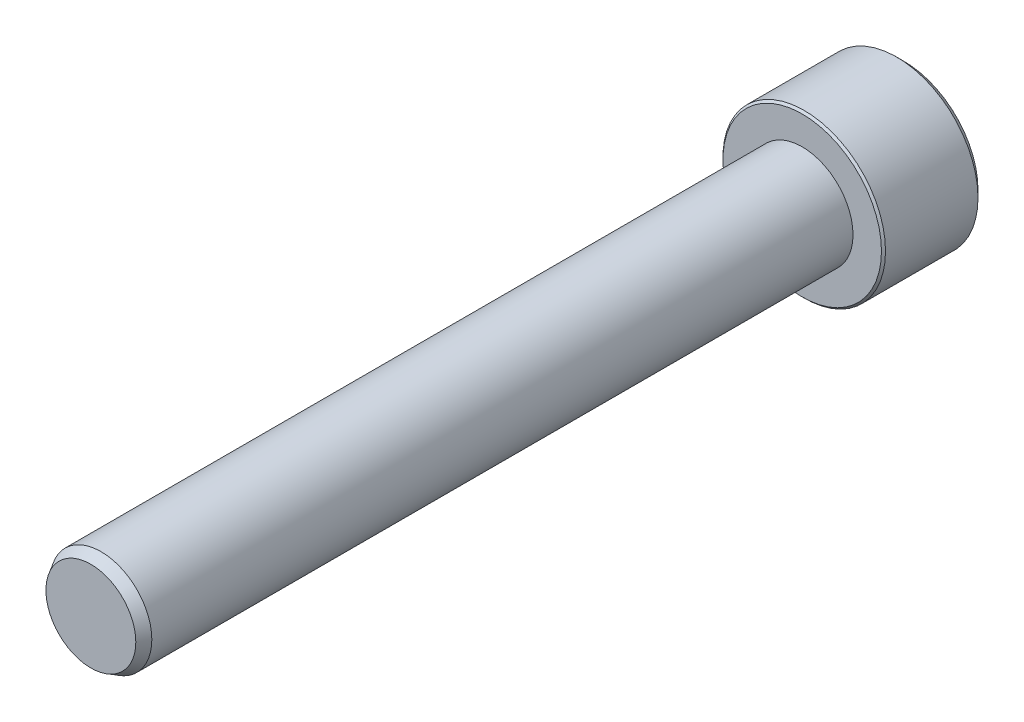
ISO-10303-21;
HEADER;
FILE_DESCRIPTION(('STEP AP214'),'2;1');
FILE_NAME('part.step','',(''),(''),'','','');
FILE_SCHEMA(('AUTOMOTIVE_DESIGN { 1 0 10303 214 1 1 1 1 }'));
ENDSEC;
DATA;
#1=APPLICATION_CONTEXT('core data for automotive mechanical design processes');
#2=APPLICATION_PROTOCOL_DEFINITION('international standard','automotive_design',2000,#1);
#3=PRODUCT_CONTEXT('',#1,'mechanical');
#4=PRODUCT('Part','Part','',(#3));
#5=PRODUCT_RELATED_PRODUCT_CATEGORY('part','',(#4));
#6=PRODUCT_DEFINITION_FORMATION('','',#4);
#7=PRODUCT_DEFINITION_CONTEXT('part definition',#1,'design');
#8=PRODUCT_DEFINITION('design','',#6,#7);
#9=PRODUCT_DEFINITION_SHAPE('','',#8);
#10=(LENGTH_UNIT() NAMED_UNIT(*) SI_UNIT(.MILLI.,.METRE.));
#11=(NAMED_UNIT(*) PLANE_ANGLE_UNIT() SI_UNIT($,.RADIAN.));
#12=(NAMED_UNIT(*) SI_UNIT($,.STERADIAN.) SOLID_ANGLE_UNIT());
#13=UNCERTAINTY_MEASURE_WITH_UNIT(LENGTH_MEASURE(1.E-05),#10,'distance_accuracy_value','');
#14=(GEOMETRIC_REPRESENTATION_CONTEXT(3) GLOBAL_UNCERTAINTY_ASSIGNED_CONTEXT((#13)) GLOBAL_UNIT_ASSIGNED_CONTEXT((#10,
#11,#12)) REPRESENTATION_CONTEXT('',''));
#15=CARTESIAN_POINT('',(0.,0.,0.));
#16=DIRECTION('',(0.,0.,1.));
#17=DIRECTION('',(1.,0.,0.));
#18=AXIS2_PLACEMENT_3D('',#15,#16,#17);
#19=CARTESIAN_POINT('',(0.,0.,-10.));
#20=DIRECTION('',(0.,0.,1.));
#21=DIRECTION('',(1.,0.,0.));
#22=AXIS2_PLACEMENT_3D('',#19,#20,#21);
#23=PLANE('',#22);
#24=CARTESIAN_POINT('',(0.,0.,-10.));
#25=DIRECTION('',(0.,0.,1.));
#26=DIRECTION('',(1.,0.,0.));
#27=AXIS2_PLACEMENT_3D('',#24,#25,#26);
#28=CIRCLE('',#27,7.3);
#29=CARTESIAN_POINT('',(7.3,0.,-10.));
#30=VERTEX_POINT('',#29);
#31=EDGE_CURVE('E140',#30,#30,#28,.F.);
#32=ORIENTED_EDGE('',*,*,#31,.T.);
#33=EDGE_LOOP('',(#32));
#34=FACE_BOUND('',#33,.T.);
#35=DIRECTION('',(-0.5,-0.866025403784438,0.));
#36=VECTOR('',#35,1.);
#37=CARTESIAN_POINT('',(-2.3094010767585,4.,-10.));
#38=LINE('',#37,#36);
#39=CARTESIAN_POINT('',(-2.3094010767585,4.,-10.));
#40=VERTEX_POINT('',#39);
#41=CARTESIAN_POINT('',(-4.61880215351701,0.,-10.));
#42=VERTEX_POINT('',#41);
#43=EDGE_CURVE('E47',#40,#42,#38,.T.);
#44=ORIENTED_EDGE('',*,*,#43,.T.);
#45=DIRECTION('',(0.5,-0.866025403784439,0.));
#46=VECTOR('',#45,1.);
#47=CARTESIAN_POINT('',(-4.61880215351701,0.,-10.));
#48=LINE('',#47,#46);
#49=CARTESIAN_POINT('',(-2.3094010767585,-4.,-10.));
#50=VERTEX_POINT('',#49);
#51=EDGE_CURVE('E87',#42,#50,#48,.T.);
#52=ORIENTED_EDGE('',*,*,#51,.T.);
#53=DIRECTION('',(1.,0.,0.));
#54=VECTOR('',#53,1.);
#55=CARTESIAN_POINT('',(-2.3094010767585,-4.,-10.));
#56=LINE('',#55,#54);
#57=CARTESIAN_POINT('',(2.30940107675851,-4.,-10.));
#58=VERTEX_POINT('',#57);
#59=EDGE_CURVE('E95',#50,#58,#56,.T.);
#60=ORIENTED_EDGE('',*,*,#59,.T.);
#61=DIRECTION('',(0.5,0.866025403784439,0.));
#62=VECTOR('',#61,1.);
#63=CARTESIAN_POINT('',(2.30940107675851,-4.,-10.));
#64=LINE('',#63,#62);
#65=CARTESIAN_POINT('',(4.61880215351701,0.,-10.));
#66=VERTEX_POINT('',#65);
#67=EDGE_CURVE('E110',#58,#66,#64,.T.);
#68=ORIENTED_EDGE('',*,*,#67,.T.);
#69=DIRECTION('',(-0.5,0.866025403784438,0.));
#70=VECTOR('',#69,1.);
#71=CARTESIAN_POINT('',(2.3094010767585,4.,-10.));
#72=LINE('',#71,#70);
#73=CARTESIAN_POINT('',(2.3094010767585,4.,-10.));
#74=VERTEX_POINT('',#73);
#75=EDGE_CURVE('E113',#66,#74,#72,.T.);
#76=ORIENTED_EDGE('',*,*,#75,.T.);
#77=DIRECTION('',(-1.,0.,0.));
#78=VECTOR('',#77,1.);
#79=CARTESIAN_POINT('',(-2.3094010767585,4.,-10.));
#80=LINE('',#79,#78);
#81=EDGE_CURVE('E106',#74,#40,#80,.T.);
#82=ORIENTED_EDGE('',*,*,#81,.T.);
#83=EDGE_LOOP('',(#44,#52,#60,#68,#76,#82));
#84=FACE_BOUND('',#83,.T.);
#85=ADVANCED_FACE('F32',(#34,#84),#23,.F.);
#86=CARTESIAN_POINT('',(0.,0.,70.));
#87=DIRECTION('',(0.,0.,-1.));
#88=DIRECTION('',(-1.,0.,0.));
#89=AXIS2_PLACEMENT_3D('',#86,#87,#88);
#90=CYLINDRICAL_SURFACE('',#89,5.);
#91=CARTESIAN_POINT('',(0.,0.,69.));
#92=DIRECTION('',(0.,0.,1.));
#93=DIRECTION('',(1.,0.,0.));
#94=AXIS2_PLACEMENT_3D('',#91,#92,#93);
#95=CIRCLE('',#94,5.);
#96=CARTESIAN_POINT('',(5.,0.,69.));
#97=VERTEX_POINT('',#96);
#98=EDGE_CURVE('E146',#97,#97,#95,.F.);
#99=ORIENTED_EDGE('',*,*,#98,.T.);
#100=EDGE_LOOP('',(#99));
#101=FACE_BOUND('',#100,.T.);
#102=CARTESIAN_POINT('',(0.,0.,0.));
#103=DIRECTION('',(0.,0.,1.));
#104=DIRECTION('',(1.,0.,0.));
#105=AXIS2_PLACEMENT_3D('',#102,#103,#104);
#106=CIRCLE('',#105,5.);
#107=CARTESIAN_POINT('',(5.,0.,0.));
#108=VERTEX_POINT('',#107);
#109=EDGE_CURVE('E101',#108,#108,#106,.T.);
#110=ORIENTED_EDGE('',*,*,#109,.T.);
#111=EDGE_LOOP('',(#110));
#112=FACE_BOUND('',#111,.T.);
#113=ADVANCED_FACE('F34',(#101,#112),#90,.T.);
#114=CARTESIAN_POINT('',(0.,0.,70.));
#115=DIRECTION('',(0.,0.,1.));
#116=DIRECTION('',(1.,0.,0.));
#117=AXIS2_PLACEMENT_3D('',#114,#115,#116);
#118=PLANE('',#117);
#119=CARTESIAN_POINT('',(0.,0.,70.));
#120=DIRECTION('',(0.,0.,1.));
#121=DIRECTION('',(1.,0.,0.));
#122=AXIS2_PLACEMENT_3D('',#119,#120,#121);
#123=CIRCLE('',#122,4.42264973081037);
#124=CARTESIAN_POINT('',(4.42264973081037,0.,70.));
#125=VERTEX_POINT('',#124);
#126=EDGE_CURVE('E143',#125,#125,#123,.T.);
#127=ORIENTED_EDGE('',*,*,#126,.T.);
#128=EDGE_LOOP('',(#127));
#129=FACE_BOUND('',#128,.T.);
#130=ADVANCED_FACE('F172',(#129),#118,.T.);
#131=CARTESIAN_POINT('',(0.,0.,0.));
#132=DIRECTION('',(0.,0.,1.));
#133=DIRECTION('',(1.,0.,0.));
#134=AXIS2_PLACEMENT_3D('',#131,#132,#133);
#135=PLANE('',#134);
#136=CARTESIAN_POINT('',(0.,0.,0.));
#137=DIRECTION('',(0.,0.,1.));
#138=DIRECTION('',(1.,0.,0.));
#139=AXIS2_PLACEMENT_3D('',#136,#137,#138);
#140=CIRCLE('',#139,7.8);
#141=CARTESIAN_POINT('',(7.8,0.,0.));
#142=VERTEX_POINT('',#141);
#143=EDGE_CURVE('E40',#142,#142,#140,.T.);
#144=ORIENTED_EDGE('',*,*,#143,.T.);
#145=EDGE_LOOP('',(#144));
#146=FACE_BOUND('',#145,.T.);
#147=ORIENTED_EDGE('',*,*,#109,.F.);
#148=EDGE_LOOP('',(#147));
#149=FACE_BOUND('',#148,.T.);
#150=ADVANCED_FACE('F151',(#146,#149),#135,.T.);
#151=CARTESIAN_POINT('',(0.,0.,-10.));
#152=DIRECTION('',(0.,0.,1.));
#153=DIRECTION('',(1.,0.,0.));
#154=AXIS2_PLACEMENT_3D('',#151,#152,#153);
#155=CYLINDRICAL_SURFACE('',#154,8.);
#156=CARTESIAN_POINT('',(0.,0.,-0.200000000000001));
#157=DIRECTION('',(0.,0.,1.));
#158=DIRECTION('',(1.,0.,0.));
#159=AXIS2_PLACEMENT_3D('',#156,#157,#158);
#160=CIRCLE('',#159,8.);
#161=CARTESIAN_POINT('',(8.,0.,-0.200000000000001));
#162=VERTEX_POINT('',#161);
#163=EDGE_CURVE('E11',#162,#162,#160,.F.);
#164=ORIENTED_EDGE('',*,*,#163,.T.);
#165=EDGE_LOOP('',(#164));
#166=FACE_BOUND('',#165,.T.);
#167=CARTESIAN_POINT('',(0.,0.,-9.3));
#168=DIRECTION('',(0.,0.,1.));
#169=DIRECTION('',(1.,0.,0.));
#170=AXIS2_PLACEMENT_3D('',#167,#168,#169);
#171=CIRCLE('',#170,8.);
#172=CARTESIAN_POINT('',(8.,0.,-9.3));
#173=VERTEX_POINT('',#172);
#174=EDGE_CURVE('E137',#173,#173,#171,.T.);
#175=ORIENTED_EDGE('',*,*,#174,.T.);
#176=EDGE_LOOP('',(#175));
#177=FACE_BOUND('',#176,.T.);
#178=ADVANCED_FACE('F177',(#166,#177),#155,.T.);
#179=CARTESIAN_POINT('',(-2.3094010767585,4.,-4.5));
#180=DIRECTION('',(0.866025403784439,-0.5,0.));
#181=DIRECTION('',(0.5,0.866025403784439,0.));
#182=AXIS2_PLACEMENT_3D('',#179,#180,#181);
#183=PLANE('',#182);
#184=ORIENTED_EDGE('',*,*,#43,.F.);
#185=DIRECTION('',(0.,0.,-1.));
#186=VECTOR('',#185,1.);
#187=CARTESIAN_POINT('',(-2.3094010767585,4.,-4.5));
#188=LINE('',#187,#186);
#189=CARTESIAN_POINT('',(-2.3094010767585,4.,-4.5));
#190=VERTEX_POINT('',#189);
#191=EDGE_CURVE('E126',#190,#40,#188,.T.);
#192=ORIENTED_EDGE('',*,*,#191,.F.);
#193=DIRECTION('',(-0.5,-0.866025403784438,0.));
#194=VECTOR('',#193,1.);
#195=CARTESIAN_POINT('',(-2.3094010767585,4.,-4.5));
#196=LINE('',#195,#194);
#197=CARTESIAN_POINT('',(-4.61880215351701,0.,-4.5));
#198=VERTEX_POINT('',#197);
#199=EDGE_CURVE('E100',#190,#198,#196,.T.);
#200=ORIENTED_EDGE('',*,*,#199,.T.);
#201=DIRECTION('',(0.,0.,-1.));
#202=VECTOR('',#201,1.);
#203=CARTESIAN_POINT('',(-4.61880215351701,0.,-4.5));
#204=LINE('',#203,#202);
#205=EDGE_CURVE('E89',#198,#42,#204,.T.);
#206=ORIENTED_EDGE('',*,*,#205,.T.);
#207=EDGE_LOOP('',(#184,#192,#200,#206));
#208=FACE_BOUND('',#207,.T.);
#209=ADVANCED_FACE('F98',(#208),#183,.T.);
#210=CARTESIAN_POINT('',(-4.61880215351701,0.,-4.5));
#211=DIRECTION('',(0.866025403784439,0.5,0.));
#212=DIRECTION('',(-0.5,0.866025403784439,0.));
#213=AXIS2_PLACEMENT_3D('',#210,#211,#212);
#214=PLANE('',#213);
#215=ORIENTED_EDGE('',*,*,#51,.F.);
#216=ORIENTED_EDGE('',*,*,#205,.F.);
#217=DIRECTION('',(0.5,-0.866025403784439,0.));
#218=VECTOR('',#217,1.);
#219=CARTESIAN_POINT('',(-4.61880215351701,0.,-4.5));
#220=LINE('',#219,#218);
#221=CARTESIAN_POINT('',(-2.3094010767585,-4.,-4.5));
#222=VERTEX_POINT('',#221);
#223=EDGE_CURVE('E117',#198,#222,#220,.T.);
#224=ORIENTED_EDGE('',*,*,#223,.T.);
#225=DIRECTION('',(0.,0.,-1.));
#226=VECTOR('',#225,1.);
#227=CARTESIAN_POINT('',(-2.3094010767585,-4.,-4.5));
#228=LINE('',#227,#226);
#229=EDGE_CURVE('E91',#222,#50,#228,.T.);
#230=ORIENTED_EDGE('',*,*,#229,.T.);
#231=EDGE_LOOP('',(#215,#216,#224,#230));
#232=FACE_BOUND('',#231,.T.);
#233=ADVANCED_FACE('F88',(#232),#214,.T.);
#234=CARTESIAN_POINT('',(-2.3094010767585,-4.,-4.5));
#235=DIRECTION('',(0.,1.,0.));
#236=DIRECTION('',(0.,0.,1.));
#237=AXIS2_PLACEMENT_3D('',#234,#235,#236);
#238=PLANE('',#237);
#239=ORIENTED_EDGE('',*,*,#59,.F.);
#240=ORIENTED_EDGE('',*,*,#229,.F.);
#241=DIRECTION('',(1.,0.,0.));
#242=VECTOR('',#241,1.);
#243=CARTESIAN_POINT('',(-2.3094010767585,-4.,-4.5));
#244=LINE('',#243,#242);
#245=CARTESIAN_POINT('',(2.30940107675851,-4.,-4.5));
#246=VERTEX_POINT('',#245);
#247=EDGE_CURVE('E119',#222,#246,#244,.T.);
#248=ORIENTED_EDGE('',*,*,#247,.T.);
#249=DIRECTION('',(0.,0.,-1.));
#250=VECTOR('',#249,1.);
#251=CARTESIAN_POINT('',(2.30940107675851,-4.,-4.5));
#252=LINE('',#251,#250);
#253=EDGE_CURVE('E132',#246,#58,#252,.T.);
#254=ORIENTED_EDGE('',*,*,#253,.T.);
#255=EDGE_LOOP('',(#239,#240,#248,#254));
#256=FACE_BOUND('',#255,.T.);
#257=ADVANCED_FACE('F205',(#256),#238,.T.);
#258=CARTESIAN_POINT('',(2.30940107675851,-4.,-4.5));
#259=DIRECTION('',(-0.866025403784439,0.5,0.));
#260=DIRECTION('',(-0.5,-0.866025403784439,0.));
#261=AXIS2_PLACEMENT_3D('',#258,#259,#260);
#262=PLANE('',#261);
#263=ORIENTED_EDGE('',*,*,#67,.F.);
#264=ORIENTED_EDGE('',*,*,#253,.F.);
#265=DIRECTION('',(0.5,0.866025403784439,0.));
#266=VECTOR('',#265,1.);
#267=CARTESIAN_POINT('',(2.30940107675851,-4.,-4.5));
#268=LINE('',#267,#266);
#269=CARTESIAN_POINT('',(4.61880215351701,0.,-4.5));
#270=VERTEX_POINT('',#269);
#271=EDGE_CURVE('E121',#246,#270,#268,.T.);
#272=ORIENTED_EDGE('',*,*,#271,.T.);
#273=DIRECTION('',(0.,0.,-1.));
#274=VECTOR('',#273,1.);
#275=CARTESIAN_POINT('',(4.61880215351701,0.,-4.5));
#276=LINE('',#275,#274);
#277=EDGE_CURVE('E130',#270,#66,#276,.T.);
#278=ORIENTED_EDGE('',*,*,#277,.T.);
#279=EDGE_LOOP('',(#263,#264,#272,#278));
#280=FACE_BOUND('',#279,.T.);
#281=ADVANCED_FACE('F212',(#280),#262,.T.);
#282=CARTESIAN_POINT('',(2.3094010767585,4.,-4.5));
#283=DIRECTION('',(-0.866025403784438,-0.5,0.));
#284=DIRECTION('',(0.5,-0.866025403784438,0.));
#285=AXIS2_PLACEMENT_3D('',#282,#283,#284);
#286=PLANE('',#285);
#287=ORIENTED_EDGE('',*,*,#75,.F.);
#288=ORIENTED_EDGE('',*,*,#277,.F.);
#289=DIRECTION('',(-0.5,0.866025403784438,0.));
#290=VECTOR('',#289,1.);
#291=CARTESIAN_POINT('',(2.3094010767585,4.,-4.5));
#292=LINE('',#291,#290);
#293=CARTESIAN_POINT('',(2.3094010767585,4.,-4.5));
#294=VERTEX_POINT('',#293);
#295=EDGE_CURVE('E123',#270,#294,#292,.T.);
#296=ORIENTED_EDGE('',*,*,#295,.T.);
#297=DIRECTION('',(0.,0.,-1.));
#298=VECTOR('',#297,1.);
#299=CARTESIAN_POINT('',(2.3094010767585,4.,-4.5));
#300=LINE('',#299,#298);
#301=EDGE_CURVE('E128',#294,#74,#300,.T.);
#302=ORIENTED_EDGE('',*,*,#301,.T.);
#303=EDGE_LOOP('',(#287,#288,#296,#302));
#304=FACE_BOUND('',#303,.T.);
#305=ADVANCED_FACE('F220',(#304),#286,.T.);
#306=CARTESIAN_POINT('',(-2.3094010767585,4.,-4.5));
#307=DIRECTION('',(0.,-1.,0.));
#308=DIRECTION('',(0.,0.,-1.));
#309=AXIS2_PLACEMENT_3D('',#306,#307,#308);
#310=PLANE('',#309);
#311=ORIENTED_EDGE('',*,*,#81,.F.);
#312=ORIENTED_EDGE('',*,*,#301,.F.);
#313=DIRECTION('',(-1.,0.,0.));
#314=VECTOR('',#313,1.);
#315=CARTESIAN_POINT('',(-2.3094010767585,4.,-4.5));
#316=LINE('',#315,#314);
#317=EDGE_CURVE('E54',#294,#190,#316,.T.);
#318=ORIENTED_EDGE('',*,*,#317,.T.);
#319=ORIENTED_EDGE('',*,*,#191,.T.);
#320=EDGE_LOOP('',(#311,#312,#318,#319));
#321=FACE_BOUND('',#320,.T.);
#322=ADVANCED_FACE('F228',(#321),#310,.T.);
#323=CARTESIAN_POINT('',(0.,8.,-4.5));
#324=DIRECTION('',(0.,0.,1.));
#325=DIRECTION('',(1.,0.,0.));
#326=AXIS2_PLACEMENT_3D('',#323,#324,#325);
#327=PLANE('',#326);
#328=ORIENTED_EDGE('',*,*,#199,.F.);
#329=ORIENTED_EDGE('',*,*,#317,.F.);
#330=ORIENTED_EDGE('',*,*,#295,.F.);
#331=ORIENTED_EDGE('',*,*,#271,.F.);
#332=ORIENTED_EDGE('',*,*,#247,.F.);
#333=ORIENTED_EDGE('',*,*,#223,.F.);
#334=EDGE_LOOP('',(#328,#329,#330,#331,#332,#333));
#335=FACE_BOUND('',#334,.T.);
#336=ADVANCED_FACE('F236',(#335),#327,.F.);
#337=CARTESIAN_POINT('',(0.,0.,-9.3));
#338=DIRECTION('',(0.,0.,1.));
#339=DIRECTION('',(1.,0.,0.));
#340=AXIS2_PLACEMENT_3D('',#337,#338,#339);
#341=CONICAL_SURFACE('',#340,8.,0.785398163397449);
#342=ORIENTED_EDGE('',*,*,#31,.F.);
#343=EDGE_LOOP('',(#342));
#344=FACE_BOUND('',#343,.T.);
#345=ORIENTED_EDGE('',*,*,#174,.F.);
#346=EDGE_LOOP('',(#345));
#347=FACE_BOUND('',#346,.T.);
#348=ADVANCED_FACE('F162',(#344,#347),#341,.T.);
#349=CARTESIAN_POINT('',(0.,0.,70.));
#350=DIRECTION('',(0.,0.,-1.));
#351=DIRECTION('',(-1.,0.,0.));
#352=AXIS2_PLACEMENT_3D('',#349,#350,#351);
#353=CONICAL_SURFACE('',#352,4.42264973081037,0.523598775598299);
#354=ORIENTED_EDGE('',*,*,#98,.F.);
#355=EDGE_LOOP('',(#354));
#356=FACE_BOUND('',#355,.T.);
#357=ORIENTED_EDGE('',*,*,#126,.F.);
#358=EDGE_LOOP('',(#357));
#359=FACE_BOUND('',#358,.T.);
#360=ADVANCED_FACE('F156',(#356,#359),#353,.T.);
#361=CARTESIAN_POINT('',(0.,0.,0.));
#362=DIRECTION('',(0.,0.,-1.));
#363=DIRECTION('',(-1.,0.,0.));
#364=AXIS2_PLACEMENT_3D('',#361,#362,#363);
#365=CONICAL_SURFACE('',#364,7.8,0.785398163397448);
#366=ORIENTED_EDGE('',*,*,#163,.F.);
#367=EDGE_LOOP('',(#366));
#368=FACE_BOUND('',#367,.T.);
#369=ORIENTED_EDGE('',*,*,#143,.F.);
#370=EDGE_LOOP('',(#369));
#371=FACE_BOUND('',#370,.T.);
#372=ADVANCED_FACE('F154',(#368,#371),#365,.T.);
#373=CLOSED_SHELL('',(#85,#113,#130,#150,#178,#209,#233,#257,#281,#305,#322,#336,#348,#360,#372));
#374=MANIFOLD_SOLID_BREP('B2',#373);
#375=ADVANCED_BREP_SHAPE_REPRESENTATION('',(#18,#374),#14);
#376=SHAPE_DEFINITION_REPRESENTATION(#9,#375);
ENDSEC;
END-ISO-10303-21;
